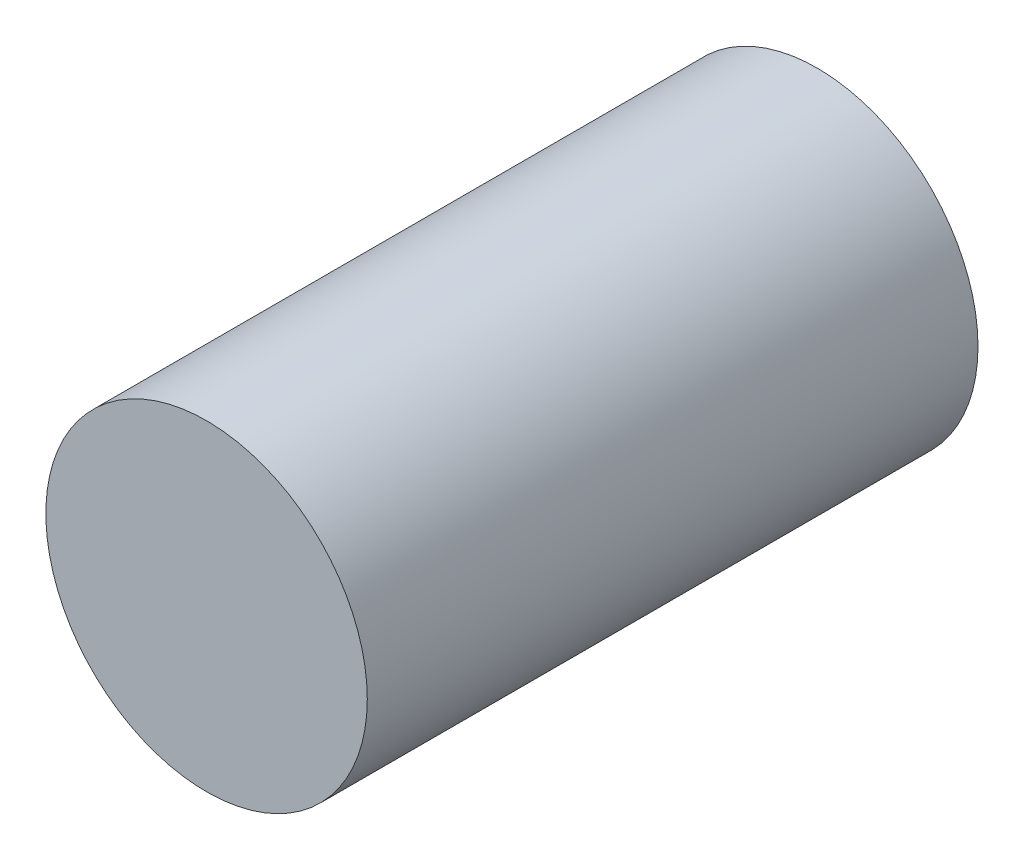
ISO-10303-21;
HEADER;
FILE_DESCRIPTION(('STEP AP214'),'2;1');
FILE_NAME('part.step','',(''),(''),'','','');
FILE_SCHEMA(('AUTOMOTIVE_DESIGN { 1 0 10303 214 1 1 1 1 }'));
ENDSEC;
DATA;
#1=APPLICATION_CONTEXT('core data for automotive mechanical design processes');
#2=APPLICATION_PROTOCOL_DEFINITION('international standard','automotive_design',2000,#1);
#3=PRODUCT_CONTEXT('',#1,'mechanical');
#4=PRODUCT('Part','Part','',(#3));
#5=PRODUCT_RELATED_PRODUCT_CATEGORY('part','',(#4));
#6=PRODUCT_DEFINITION_FORMATION('','',#4);
#7=PRODUCT_DEFINITION_CONTEXT('part definition',#1,'design');
#8=PRODUCT_DEFINITION('design','',#6,#7);
#9=PRODUCT_DEFINITION_SHAPE('','',#8);
#10=(LENGTH_UNIT() NAMED_UNIT(*) SI_UNIT(.MILLI.,.METRE.));
#11=(NAMED_UNIT(*) PLANE_ANGLE_UNIT() SI_UNIT($,.RADIAN.));
#12=(NAMED_UNIT(*) SI_UNIT($,.STERADIAN.) SOLID_ANGLE_UNIT());
#13=UNCERTAINTY_MEASURE_WITH_UNIT(LENGTH_MEASURE(1.E-05),#10,'distance_accuracy_value','');
#14=(GEOMETRIC_REPRESENTATION_CONTEXT(3) GLOBAL_UNCERTAINTY_ASSIGNED_CONTEXT((#13)) GLOBAL_UNIT_ASSIGNED_CONTEXT((#10,
#11,#12)) REPRESENTATION_CONTEXT('',''));
#15=CARTESIAN_POINT('',(0.,0.,0.));
#16=DIRECTION('',(0.,0.,1.));
#17=DIRECTION('',(1.,0.,0.));
#18=AXIS2_PLACEMENT_3D('',#15,#16,#17);
#19=CARTESIAN_POINT('',(0.,0.,95.));
#20=DIRECTION('',(0.,0.,-1.));
#21=DIRECTION('',(-1.,0.,0.));
#22=AXIS2_PLACEMENT_3D('',#19,#20,#21);
#23=CYLINDRICAL_SURFACE('',#22,25.);
#24=CARTESIAN_POINT('',(0.,0.,95.));
#25=DIRECTION('',(0.,0.,1.));
#26=DIRECTION('',(1.,0.,0.));
#27=AXIS2_PLACEMENT_3D('',#24,#25,#26);
#28=CIRCLE('',#27,25.);
#29=CARTESIAN_POINT('',(25.,0.,95.));
#30=VERTEX_POINT('',#29);
#31=EDGE_CURVE('E10',#30,#30,#28,.T.);
#32=ORIENTED_EDGE('',*,*,#31,.F.);
#33=EDGE_LOOP('',(#32));
#34=FACE_BOUND('',#33,.T.);
#35=CARTESIAN_POINT('',(0.,0.,0.));
#36=DIRECTION('',(0.,0.,1.));
#37=DIRECTION('',(1.,0.,0.));
#38=AXIS2_PLACEMENT_3D('',#35,#36,#37);
#39=CIRCLE('',#38,25.);
#40=CARTESIAN_POINT('',(25.,0.,0.));
#41=VERTEX_POINT('',#40);
#42=EDGE_CURVE('E44',#41,#41,#39,.T.);
#43=ORIENTED_EDGE('',*,*,#42,.T.);
#44=EDGE_LOOP('',(#43));
#45=FACE_BOUND('',#44,.T.);
#46=ADVANCED_FACE('F41',(#34,#45),#23,.T.);
#47=CARTESIAN_POINT('',(0.,0.,95.));
#48=DIRECTION('',(0.,0.,1.));
#49=DIRECTION('',(1.,0.,0.));
#50=AXIS2_PLACEMENT_3D('',#47,#48,#49);
#51=PLANE('',#50);
#52=ORIENTED_EDGE('',*,*,#31,.T.);
#53=EDGE_LOOP('',(#52));
#54=FACE_BOUND('',#53,.T.);
#55=ADVANCED_FACE('F56',(#54),#51,.T.);
#56=CARTESIAN_POINT('',(0.,0.,0.));
#57=DIRECTION('',(0.,0.,1.));
#58=DIRECTION('',(1.,0.,0.));
#59=AXIS2_PLACEMENT_3D('',#56,#57,#58);
#60=PLANE('',#59);
#61=ORIENTED_EDGE('',*,*,#42,.F.);
#62=EDGE_LOOP('',(#61));
#63=FACE_BOUND('',#62,.T.);
#64=ADVANCED_FACE('F54',(#63),#60,.F.);
#65=CLOSED_SHELL('',(#46,#55,#64));
#66=MANIFOLD_SOLID_BREP('B2',#65);
#67=ADVANCED_BREP_SHAPE_REPRESENTATION('',(#18,#66),#14);
#68=SHAPE_DEFINITION_REPRESENTATION(#9,#67);
ENDSEC;
END-ISO-10303-21;
